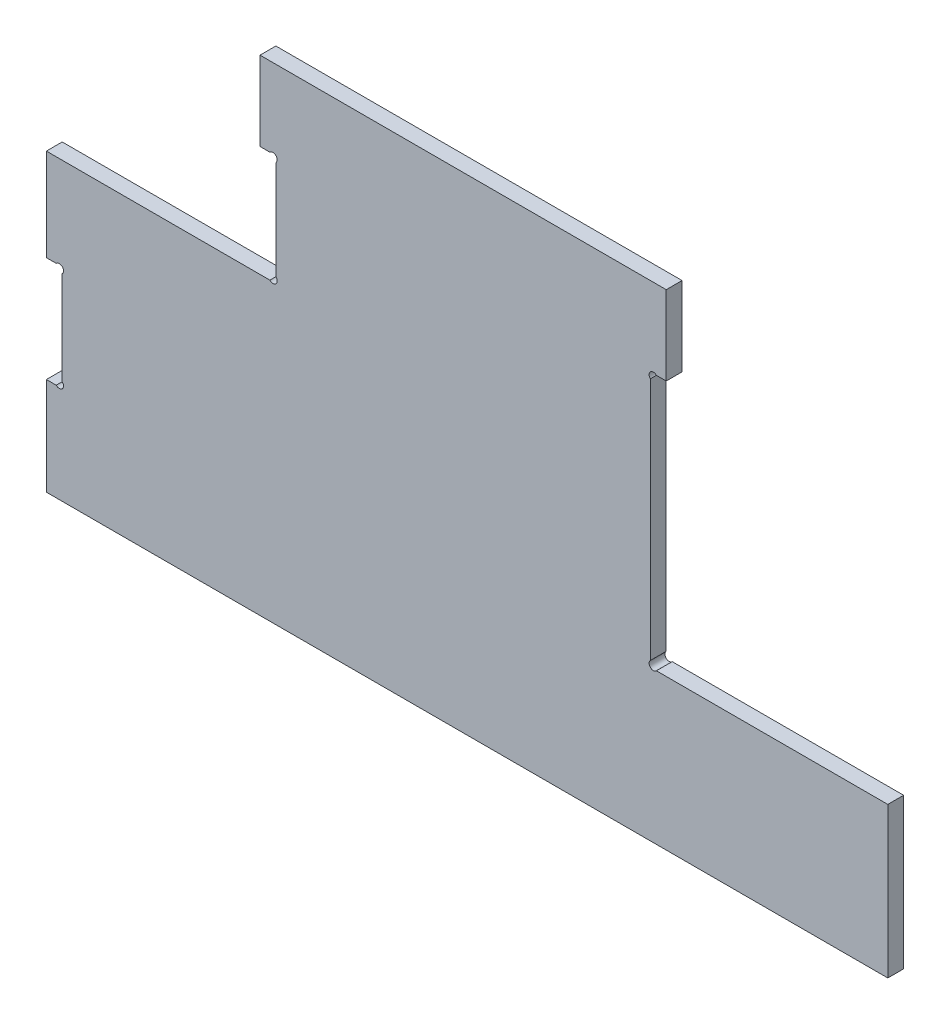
from build123d import *

# Parameters (mm, degrees)
BASE_EXTRUSION_DEPTH    = 6
ESQUISSE8_W             = 6
ESQUISSE8_H             = 30
EXTRUSION1_DEPTH        = 6
ESQUISSE9_W             = 6
ESQUISSE9_H             = 112
EXTRUSION2_DEPTH        = 81
ESQUISSE10_W            = 6
ESQUISSE10_H            = 40
ENL_V_MAT_EXTRU_5_DEPTH = 6
ESQUISSE11_W            = 6
ESQUISSE11_H            = 42
ENL_V_MAT_EXTRU_6_DEPTH = 6
ESQUISSE6_R             = 1.6
ENL_V_MAT_EXTRU_4_DEPTH = 6


with BuildPart() as part:
    # Esquisse1 → Base-Extrusion (new body)
    with BuildSketch(Plane.XY):
        Polygon((132.817421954, -51.030312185), (222.817421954, -51.030312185), (222.817421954, -108.030312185), (118.817421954, -108.030312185), (-15.182578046, -108.030312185), (-15.182578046, 75.969687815), (132.817421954, 75.969687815), align=None)
    extrude(amount=BASE_EXTRUSION_DEPTH)

    # Esquisse8 → Extrusion1 (add)
    with BuildSketch(Plane(origin=(132.817421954, 0, 0), x_dir=(0, 0, -1), z_dir=(1, 0, 0))):
        with Locations((-3, 60.969687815)):
            Rectangle(ESQUISSE8_W, ESQUISSE8_H)
    extrude(amount=EXTRUSION1_DEPTH)

    # Esquisse9 → Extrusion2 (add)
    with BuildSketch(Plane.ZY.offset(15.182578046)):
        with Locations((3, -52.030312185)):
            Rectangle(ESQUISSE9_W, ESQUISSE9_H)
    extrude(amount=EXTRUSION2_DEPTH)

    # Esquisse10 → Enl_v. mat.-Extru.5 (cut)
    with BuildSketch(Plane.XY.offset(6)):
        with Locations((-93.182578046, -51.030312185)):
            Rectangle(ESQUISSE10_W, ESQUISSE10_H)
    extrude(amount=-ENL_V_MAT_EXTRU_5_DEPTH, mode=Mode.SUBTRACT)

    # Esquisse11 → Enl_v. mat.-Extru.6 (cut)
    with BuildSketch(Plane.XY.offset(6)):
        with Locations((-12.182578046, 24.969687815)):
            Rectangle(ESQUISSE11_W, ESQUISSE11_H)
    extrude(amount=-ENL_V_MAT_EXTRU_6_DEPTH, mode=Mode.SUBTRACT)

    # Esquisse6 → Enl_v. mat.-Extru.4 (cut)
    with BuildSketch(Plane(origin=(0, 0, 0), x_dir=(-1, 0, 0), z_dir=(0, 0, -1))):
        with Locations((-133.917421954, -49.930312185)):
            Circle(ESQUISSE6_R)
        with Locations((-133.917421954, 44.869687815)):
            Circle(ESQUISSE6_R)
        with Locations((91.282578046, -32.130312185)):
            Circle(ESQUISSE6_R)
        with Locations((91.282578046, -69.930312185)):
            Circle(ESQUISSE6_R)
        with Locations((10.282578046, 44.869687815)):
            Circle(ESQUISSE6_R)
        with Locations((10.282578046, 5.069687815)):
            Circle(ESQUISSE6_R)
    extrude(amount=-ENL_V_MAT_EXTRU_4_DEPTH, mode=Mode.SUBTRACT)


solid = part.part
